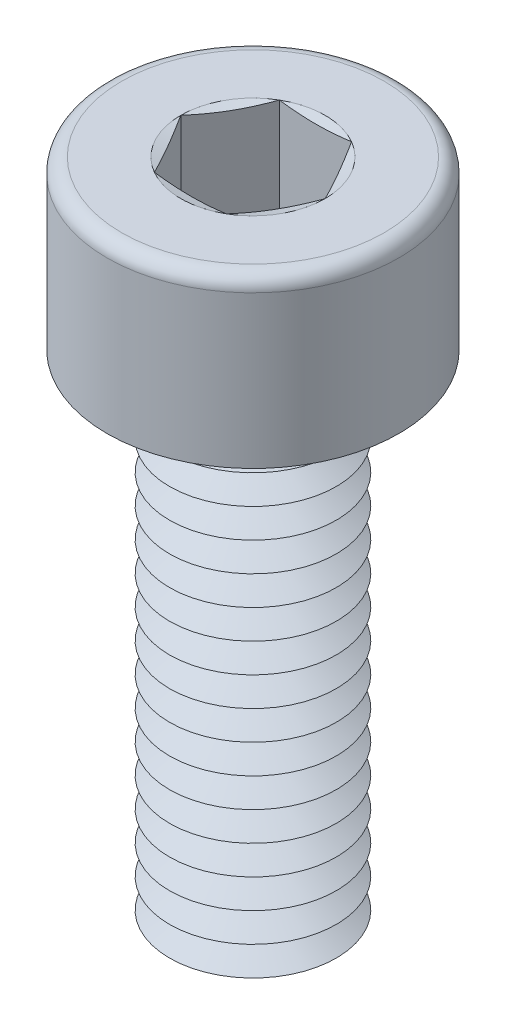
from build123d import *

# Parameters (mm, degrees)
SKETCH1_R       = 2
EXTRUDE1_DEPTH  = 12
SKETCH2_R       = 3.5
EXTRUDE2_DEPTH  = 4
EXTRUDE3_DEPTH  = 3
FILLET1_R       = 0.35
LPATTERN1_COUNT = 17
LPATTERN1_PITCH = 0.7


with BuildPart() as part:
    # Sketch1 → Extrude1 (new body)
    with BuildSketch(Plane(origin=(0, 0, 0), x_dir=(1, 0, 0), z_dir=(0, 1, 0))):
        with Locations(Location((0, 0, 0), (0, 0, 270))):
            Circle(SKETCH1_R)
    extrude(amount=EXTRUDE1_DEPTH)

    # Sketch2 → Extrude2 (add)
    with BuildSketch(Plane(origin=(0, 12, 0), x_dir=(1, 0, 0), z_dir=(0, 1, 0))):
        with Locations(Location((0, 0, 0), (0, 0, 270))):
            Circle(SKETCH2_R)
    extrude(amount=EXTRUDE2_DEPTH)

    # Sketch3 → Extrude3 (cut)
    with BuildSketch(Plane(origin=(0, 16, 0), x_dir=(1, 0, 0), z_dir=(0, 1, 0))):
        Polygon((0.866025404, 1.5), (-0.866025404, 1.5), (-1.732050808, 0), (-0.866025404, -1.5), (0.866025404, -1.5), (1.732050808, 0), align=None)
    extrude(amount=-EXTRUDE3_DEPTH, mode=Mode.SUBTRACT)

    # Fillet1
    fillet1_edges = [part.edges().sort_by_distance(p)[0] for p in [
        (0, 16, -3.5),
    ]]
    fillet(fillet1_edges, radius=FILLET1_R)

    # Sketch4 → Cut-Revolve1 (revolve, cut)
    with BuildSketch(Plane(origin=(0, 0, 0), x_dir=(0, 0, -1), z_dir=(1, 0, 0))):
        Polygon((-1.5, 13), (0, 13), (0, 12.133974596), align=None)
    revolve(axis=Axis((0, 13, 0), (0, -1, 0)), mode=Mode.SUBTRACT)

    # Sketch5 → Cut-Revolve2 (revolve, cut)
    with BuildSketch(Plane.XY, mode=Mode.PRIVATE) as cut_revolve2_sk:
        Polygon((-2, 0.35), (-2, -0.35), (-1.393782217, 0), align=None)
    cut_revolve2 = revolve(cut_revolve2_sk.sketch.rotate(Axis((0, 12, 0), (0, -1, 0)), 270), axis=Axis((0, 12, 0), (0, -1, 0)), mode=Mode.SUBTRACT)

    # LPattern1: Cut-Revolve2 ×17
    with Locations(*[(0, i * LPATTERN1_PITCH, 0) for i in range(1, LPATTERN1_COUNT)]):
        add(cut_revolve2, mode=Mode.SUBTRACT)

    # Extrude4 cone 1 section (on through the dimple's axis) → Extrude4 (revolve, cut)
    with BuildSketch(Plane(origin=(0, 16, 0), x_dir=(0, 0, 1), z_dir=(1, 0, 0))):
        Polygon((0, 0), (1.732050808, 0), (0, 0.464101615), align=None)
    revolve(axis=Axis((0, 16, 0), (0, -1, 0)), mode=Mode.SUBTRACT)


solid = part.part
